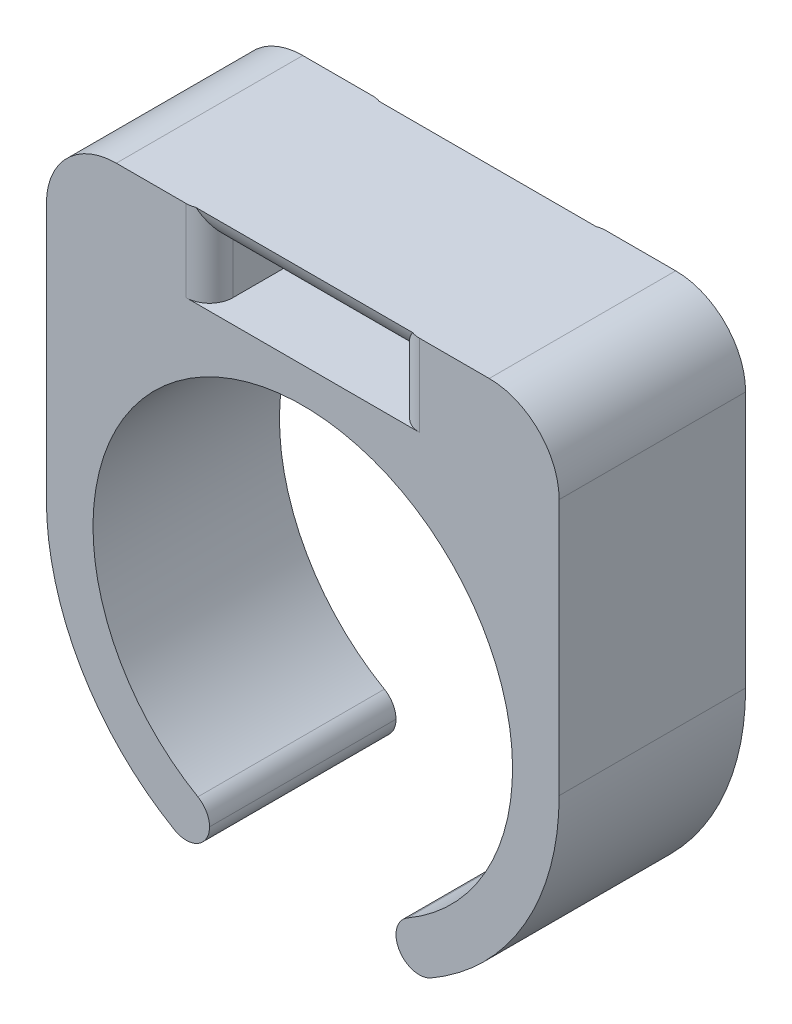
ISO-10303-21;
HEADER;
FILE_DESCRIPTION(('STEP AP214'),'2;1');
FILE_NAME('part.step','',(''),(''),'','','');
FILE_SCHEMA(('AUTOMOTIVE_DESIGN { 1 0 10303 214 1 1 1 1 }'));
ENDSEC;
DATA;
#1=APPLICATION_CONTEXT('core data for automotive mechanical design processes');
#2=APPLICATION_PROTOCOL_DEFINITION('international standard','automotive_design',2000,#1);
#3=PRODUCT_CONTEXT('',#1,'mechanical');
#4=PRODUCT('Part','Part','',(#3));
#5=PRODUCT_RELATED_PRODUCT_CATEGORY('part','',(#4));
#6=PRODUCT_DEFINITION_FORMATION('','',#4);
#7=PRODUCT_DEFINITION_CONTEXT('part definition',#1,'design');
#8=PRODUCT_DEFINITION('design','',#6,#7);
#9=PRODUCT_DEFINITION_SHAPE('','',#8);
#10=(LENGTH_UNIT() NAMED_UNIT(*) SI_UNIT(.MILLI.,.METRE.));
#11=(NAMED_UNIT(*) PLANE_ANGLE_UNIT() SI_UNIT($,.RADIAN.));
#12=(NAMED_UNIT(*) SI_UNIT($,.STERADIAN.) SOLID_ANGLE_UNIT());
#13=UNCERTAINTY_MEASURE_WITH_UNIT(LENGTH_MEASURE(1.E-05),#10,'distance_accuracy_value','');
#14=(GEOMETRIC_REPRESENTATION_CONTEXT(3) GLOBAL_UNCERTAINTY_ASSIGNED_CONTEXT((#13)) GLOBAL_UNIT_ASSIGNED_CONTEXT((#10,
#11,#12)) REPRESENTATION_CONTEXT('',''));
#15=CARTESIAN_POINT('',(0.,0.,0.));
#16=DIRECTION('',(0.,0.,1.));
#17=DIRECTION('',(1.,0.,0.));
#18=AXIS2_PLACEMENT_3D('',#15,#16,#17);
#19=CARTESIAN_POINT('',(0.,0.,8.));
#20=DIRECTION('',(0.,0.,-1.));
#21=DIRECTION('',(-1.,0.,0.));
#22=AXIS2_PLACEMENT_3D('',#19,#20,#21);
#23=CYLINDRICAL_SURFACE('',#22,11.);
#24=CARTESIAN_POINT('',(0.,0.,0.));
#25=DIRECTION('',(0.,0.,1.));
#26=DIRECTION('',(1.,0.,0.));
#27=AXIS2_PLACEMENT_3D('',#24,#25,#26);
#28=CIRCLE('',#27,11.);
#29=CARTESIAN_POINT('',(-11.,0.,0.));
#30=VERTEX_POINT('',#29);
#31=CARTESIAN_POINT('',(-5.5,-9.52627944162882,0.));
#32=VERTEX_POINT('',#31);
#33=EDGE_CURVE('E205',#30,#32,#28,.T.);
#34=ORIENTED_EDGE('',*,*,#33,.T.);
#35=DIRECTION('',(0.,0.,-1.));
#36=VECTOR('',#35,1.);
#37=CARTESIAN_POINT('',(-5.5,-9.52627944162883,8.));
#38=LINE('',#37,#36);
#39=CARTESIAN_POINT('',(-5.5,-9.52627944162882,8.));
#40=VERTEX_POINT('',#39);
#41=EDGE_CURVE('E290',#32,#40,#38,.F.);
#42=ORIENTED_EDGE('',*,*,#41,.T.);
#43=CARTESIAN_POINT('',(0.,0.,8.));
#44=DIRECTION('',(0.,0.,1.));
#45=DIRECTION('',(1.,0.,0.));
#46=AXIS2_PLACEMENT_3D('',#43,#44,#45);
#47=CIRCLE('',#46,11.);
#48=CARTESIAN_POINT('',(-11.,0.,8.));
#49=VERTEX_POINT('',#48);
#50=EDGE_CURVE('E246',#49,#40,#47,.T.);
#51=ORIENTED_EDGE('',*,*,#50,.F.);
#52=DIRECTION('',(0.,0.,1.));
#53=VECTOR('',#52,1.);
#54=CARTESIAN_POINT('',(-11.,0.,0.));
#55=LINE('',#54,#53);
#56=EDGE_CURVE('E218',#30,#49,#55,.T.);
#57=ORIENTED_EDGE('',*,*,#56,.F.);
#58=EDGE_LOOP('',(#34,#42,#51,#57));
#59=FACE_BOUND('',#58,.T.);
#60=ADVANCED_FACE('F33',(#59),#23,.T.);
#61=CARTESIAN_POINT('',(5.5,-9.52627944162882,8.));
#62=VERTEX_POINT('',#61);
#63=CARTESIAN_POINT('',(11.,0.,8.));
#64=VERTEX_POINT('',#63);
#65=EDGE_CURVE('E249',#62,#64,#47,.T.);
#66=ORIENTED_EDGE('',*,*,#65,.F.);
#67=DIRECTION('',(0.,0.,-1.));
#68=VECTOR('',#67,1.);
#69=CARTESIAN_POINT('',(5.5,-9.52627944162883,8.));
#70=LINE('',#69,#68);
#71=CARTESIAN_POINT('',(5.5,-9.52627944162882,0.));
#72=VERTEX_POINT('',#71);
#73=EDGE_CURVE('E202',#62,#72,#70,.T.);
#74=ORIENTED_EDGE('',*,*,#73,.T.);
#75=CARTESIAN_POINT('',(11.,0.,0.));
#76=VERTEX_POINT('',#75);
#77=EDGE_CURVE('E196',#72,#76,#28,.T.);
#78=ORIENTED_EDGE('',*,*,#77,.T.);
#79=DIRECTION('',(0.,0.,1.));
#80=VECTOR('',#79,1.);
#81=CARTESIAN_POINT('',(11.,0.,0.));
#82=LINE('',#81,#80);
#83=EDGE_CURVE('E200',#76,#64,#82,.T.);
#84=ORIENTED_EDGE('',*,*,#83,.T.);
#85=EDGE_LOOP('',(#66,#74,#78,#84));
#86=FACE_BOUND('',#85,.T.);
#87=ADVANCED_FACE('F199',(#86),#23,.T.);
#88=CARTESIAN_POINT('',(0.,0.,8.));
#89=DIRECTION('',(0.,0.,1.));
#90=DIRECTION('',(1.,0.,0.));
#91=AXIS2_PLACEMENT_3D('',#88,#89,#90);
#92=PLANE('',#91);
#93=DIRECTION('',(1.,0.,0.));
#94=VECTOR('',#93,1.);
#95=CARTESIAN_POINT('',(-11.,14.,8.));
#96=LINE('',#95,#94);
#97=CARTESIAN_POINT('',(5.,14.,8.));
#98=VERTEX_POINT('',#97);
#99=CARTESIAN_POINT('',(8.,14.,8.));
#100=VERTEX_POINT('',#99);
#101=EDGE_CURVE('E235',#98,#100,#96,.T.);
#102=ORIENTED_EDGE('',*,*,#101,.F.);
#103=DIRECTION('',(0.,1.,0.));
#104=VECTOR('',#103,1.);
#105=CARTESIAN_POINT('',(5.,10.5,8.));
#106=LINE('',#105,#104);
#107=CARTESIAN_POINT('',(5.,10.5,8.));
#108=VERTEX_POINT('',#107);
#109=EDGE_CURVE('E347',#98,#108,#106,.F.);
#110=ORIENTED_EDGE('',*,*,#109,.T.);
#111=DIRECTION('',(1.,0.,0.));
#112=VECTOR('',#111,1.);
#113=CARTESIAN_POINT('',(-4.,10.5,8.));
#114=LINE('',#113,#112);
#115=CARTESIAN_POINT('',(-5.,10.5,8.));
#116=VERTEX_POINT('',#115);
#117=EDGE_CURVE('E53',#116,#108,#114,.T.);
#118=ORIENTED_EDGE('',*,*,#117,.F.);
#119=DIRECTION('',(0.,-1.,0.));
#120=VECTOR('',#119,1.);
#121=CARTESIAN_POINT('',(-5.,14.,8.));
#122=LINE('',#121,#120);
#123=CARTESIAN_POINT('',(-5.,14.,8.));
#124=VERTEX_POINT('',#123);
#125=EDGE_CURVE('E345',#116,#124,#122,.F.);
#126=ORIENTED_EDGE('',*,*,#125,.T.);
#127=CARTESIAN_POINT('',(-8.,14.,8.));
#128=VERTEX_POINT('',#127);
#129=EDGE_CURVE('E237',#128,#124,#96,.T.);
#130=ORIENTED_EDGE('',*,*,#129,.F.);
#131=CARTESIAN_POINT('',(-8.,11.,8.));
#132=DIRECTION('',(0.,0.,1.));
#133=DIRECTION('',(1.,0.,0.));
#134=AXIS2_PLACEMENT_3D('',#131,#132,#133);
#135=CIRCLE('',#134,3.);
#136=CARTESIAN_POINT('',(-11.,11.,8.));
#137=VERTEX_POINT('',#136);
#138=EDGE_CURVE('E253',#128,#137,#135,.T.);
#139=ORIENTED_EDGE('',*,*,#138,.T.);
#140=DIRECTION('',(0.,1.,0.));
#141=VECTOR('',#140,1.);
#142=CARTESIAN_POINT('',(-11.,0.,8.));
#143=LINE('',#142,#141);
#144=EDGE_CURVE('E232',#49,#137,#143,.T.);
#145=ORIENTED_EDGE('',*,*,#144,.F.);
#146=ORIENTED_EDGE('',*,*,#50,.T.);
#147=CARTESIAN_POINT('',(-5.,-8.66025403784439,8.));
#148=DIRECTION('',(0.,0.,1.));
#149=DIRECTION('',(1.,0.,0.));
#150=AXIS2_PLACEMENT_3D('',#147,#148,#149);
#151=CIRCLE('',#150,1.);
#152=CARTESIAN_POINT('',(-4.,-8.66025403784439,8.));
#153=VERTEX_POINT('',#152);
#154=EDGE_CURVE('E280',#40,#153,#151,.T.);
#155=ORIENTED_EDGE('',*,*,#154,.T.);
#156=CARTESIAN_POINT('',(-5.,-8.66025403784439,8.));
#157=DIRECTION('',(0.,0.,1.));
#158=DIRECTION('',(1.,0.,0.));
#159=AXIS2_PLACEMENT_3D('',#156,#157,#158);
#160=CIRCLE('',#159,1.);
#161=CARTESIAN_POINT('',(-4.5,-7.79422863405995,8.));
#162=VERTEX_POINT('',#161);
#163=EDGE_CURVE('E278',#153,#162,#160,.T.);
#164=ORIENTED_EDGE('',*,*,#163,.T.);
#165=CARTESIAN_POINT('',(0.,0.,8.));
#166=DIRECTION('',(0.,0.,1.));
#167=DIRECTION('',(1.,0.,0.));
#168=AXIS2_PLACEMENT_3D('',#165,#166,#167);
#169=CIRCLE('',#168,9.);
#170=CARTESIAN_POINT('',(4.5,-7.79422863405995,8.));
#171=VERTEX_POINT('',#170);
#172=EDGE_CURVE('E206',#171,#162,#169,.T.);
#173=ORIENTED_EDGE('',*,*,#172,.F.);
#174=CARTESIAN_POINT('',(5.,-8.66025403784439,8.));
#175=DIRECTION('',(0.,0.,1.));
#176=DIRECTION('',(1.,0.,0.));
#177=AXIS2_PLACEMENT_3D('',#174,#175,#176);
#178=CIRCLE('',#177,1.);
#179=CARTESIAN_POINT('',(4.,-8.66025403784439,8.));
#180=VERTEX_POINT('',#179);
#181=EDGE_CURVE('E282',#171,#180,#178,.T.);
#182=ORIENTED_EDGE('',*,*,#181,.T.);
#183=CARTESIAN_POINT('',(5.,-8.66025403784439,8.));
#184=DIRECTION('',(0.,0.,1.));
#185=DIRECTION('',(1.,0.,0.));
#186=AXIS2_PLACEMENT_3D('',#183,#184,#185);
#187=CIRCLE('',#186,1.);
#188=EDGE_CURVE('E284',#180,#62,#187,.T.);
#189=ORIENTED_EDGE('',*,*,#188,.T.);
#190=ORIENTED_EDGE('',*,*,#65,.T.);
#191=DIRECTION('',(0.,1.,0.));
#192=VECTOR('',#191,1.);
#193=CARTESIAN_POINT('',(11.,0.,8.));
#194=LINE('',#193,#192);
#195=CARTESIAN_POINT('',(11.,11.,8.));
#196=VERTEX_POINT('',#195);
#197=EDGE_CURVE('E216',#64,#196,#194,.T.);
#198=ORIENTED_EDGE('',*,*,#197,.T.);
#199=CARTESIAN_POINT('',(8.,11.,8.));
#200=DIRECTION('',(0.,0.,1.));
#201=DIRECTION('',(1.,0.,0.));
#202=AXIS2_PLACEMENT_3D('',#199,#200,#201);
#203=CIRCLE('',#202,3.);
#204=EDGE_CURVE('E255',#196,#100,#203,.T.);
#205=ORIENTED_EDGE('',*,*,#204,.T.);
#206=EDGE_LOOP('',(#102,#110,#118,#126,#130,#139,#145,#146,#155,#164,#173,#182,#189,#190,#198,#205));
#207=FACE_BOUND('',#206,.T.);
#208=ADVANCED_FACE('F409',(#207),#92,.T.);
#209=CARTESIAN_POINT('',(0.,0.,0.));
#210=DIRECTION('',(0.,0.,1.));
#211=DIRECTION('',(1.,0.,0.));
#212=AXIS2_PLACEMENT_3D('',#209,#210,#211);
#213=PLANE('',#212);
#214=DIRECTION('',(1.,0.,0.));
#215=VECTOR('',#214,1.);
#216=CARTESIAN_POINT('',(-11.,14.,0.));
#217=LINE('',#216,#215);
#218=CARTESIAN_POINT('',(-8.,14.,0.));
#219=VERTEX_POINT('',#218);
#220=CARTESIAN_POINT('',(-5.,14.,0.));
#221=VERTEX_POINT('',#220);
#222=EDGE_CURVE('E224',#219,#221,#217,.T.);
#223=ORIENTED_EDGE('',*,*,#222,.T.);
#224=DIRECTION('',(0.,-1.,0.));
#225=VECTOR('',#224,1.);
#226=CARTESIAN_POINT('',(-5.,0.,0.));
#227=LINE('',#226,#225);
#228=CARTESIAN_POINT('',(-5.,10.5,0.));
#229=VERTEX_POINT('',#228);
#230=EDGE_CURVE('E322',#221,#229,#227,.T.);
#231=ORIENTED_EDGE('',*,*,#230,.T.);
#232=DIRECTION('',(1.,0.,0.));
#233=VECTOR('',#232,1.);
#234=CARTESIAN_POINT('',(-4.,10.5,0.));
#235=LINE('',#234,#233);
#236=CARTESIAN_POINT('',(5.,10.5,0.));
#237=VERTEX_POINT('',#236);
#238=EDGE_CURVE('E453',#229,#237,#235,.T.);
#239=ORIENTED_EDGE('',*,*,#238,.T.);
#240=DIRECTION('',(0.,1.,0.));
#241=VECTOR('',#240,1.);
#242=CARTESIAN_POINT('',(5.,0.,0.));
#243=LINE('',#242,#241);
#244=CARTESIAN_POINT('',(5.,14.,0.));
#245=VERTEX_POINT('',#244);
#246=EDGE_CURVE('E319',#237,#245,#243,.T.);
#247=ORIENTED_EDGE('',*,*,#246,.T.);
#248=CARTESIAN_POINT('',(8.,14.,0.));
#249=VERTEX_POINT('',#248);
#250=EDGE_CURVE('E228',#245,#249,#217,.T.);
#251=ORIENTED_EDGE('',*,*,#250,.T.);
#252=CARTESIAN_POINT('',(8.,11.,0.));
#253=DIRECTION('',(0.,0.,1.));
#254=DIRECTION('',(1.,0.,0.));
#255=AXIS2_PLACEMENT_3D('',#252,#253,#254);
#256=CIRCLE('',#255,3.);
#257=CARTESIAN_POINT('',(11.,11.,0.));
#258=VERTEX_POINT('',#257);
#259=EDGE_CURVE('E223',#249,#258,#256,.F.);
#260=ORIENTED_EDGE('',*,*,#259,.T.);
#261=DIRECTION('',(0.,1.,0.));
#262=VECTOR('',#261,1.);
#263=CARTESIAN_POINT('',(11.,0.,0.));
#264=LINE('',#263,#262);
#265=EDGE_CURVE('E213',#76,#258,#264,.T.);
#266=ORIENTED_EDGE('',*,*,#265,.F.);
#267=ORIENTED_EDGE('',*,*,#77,.F.);
#268=CARTESIAN_POINT('',(5.,-8.66025403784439,0.));
#269=DIRECTION('',(0.,0.,1.));
#270=DIRECTION('',(1.,0.,0.));
#271=AXIS2_PLACEMENT_3D('',#268,#269,#270);
#272=CIRCLE('',#271,1.);
#273=CARTESIAN_POINT('',(4.,-8.66025403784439,0.));
#274=VERTEX_POINT('',#273);
#275=EDGE_CURVE('E276',#72,#274,#272,.F.);
#276=ORIENTED_EDGE('',*,*,#275,.T.);
#277=CARTESIAN_POINT('',(5.,-8.66025403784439,0.));
#278=DIRECTION('',(0.,0.,1.));
#279=DIRECTION('',(1.,0.,0.));
#280=AXIS2_PLACEMENT_3D('',#277,#278,#279);
#281=CIRCLE('',#280,1.);
#282=CARTESIAN_POINT('',(4.5,-7.79422863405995,0.));
#283=VERTEX_POINT('',#282);
#284=EDGE_CURVE('E274',#274,#283,#281,.F.);
#285=ORIENTED_EDGE('',*,*,#284,.T.);
#286=CARTESIAN_POINT('',(0.,0.,0.));
#287=DIRECTION('',(0.,0.,1.));
#288=DIRECTION('',(1.,0.,0.));
#289=AXIS2_PLACEMENT_3D('',#286,#287,#288);
#290=CIRCLE('',#289,9.);
#291=CARTESIAN_POINT('',(-4.5,-7.79422863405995,0.));
#292=VERTEX_POINT('',#291);
#293=EDGE_CURVE('E217',#283,#292,#290,.T.);
#294=ORIENTED_EDGE('',*,*,#293,.T.);
#295=CARTESIAN_POINT('',(-5.,-8.66025403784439,0.));
#296=DIRECTION('',(0.,0.,1.));
#297=DIRECTION('',(1.,0.,0.));
#298=AXIS2_PLACEMENT_3D('',#295,#296,#297);
#299=CIRCLE('',#298,1.);
#300=CARTESIAN_POINT('',(-4.,-8.66025403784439,0.));
#301=VERTEX_POINT('',#300);
#302=EDGE_CURVE('E270',#292,#301,#299,.F.);
#303=ORIENTED_EDGE('',*,*,#302,.T.);
#304=CARTESIAN_POINT('',(-5.,-8.66025403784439,0.));
#305=DIRECTION('',(0.,0.,1.));
#306=DIRECTION('',(1.,0.,0.));
#307=AXIS2_PLACEMENT_3D('',#304,#305,#306);
#308=CIRCLE('',#307,1.);
#309=EDGE_CURVE('E272',#301,#32,#308,.F.);
#310=ORIENTED_EDGE('',*,*,#309,.T.);
#311=ORIENTED_EDGE('',*,*,#33,.F.);
#312=DIRECTION('',(0.,1.,0.));
#313=VECTOR('',#312,1.);
#314=CARTESIAN_POINT('',(-11.,0.,0.));
#315=LINE('',#314,#313);
#316=CARTESIAN_POINT('',(-11.,11.,0.));
#317=VERTEX_POINT('',#316);
#318=EDGE_CURVE('E240',#30,#317,#315,.T.);
#319=ORIENTED_EDGE('',*,*,#318,.T.);
#320=CARTESIAN_POINT('',(-8.,11.,0.));
#321=DIRECTION('',(0.,0.,1.));
#322=DIRECTION('',(1.,0.,0.));
#323=AXIS2_PLACEMENT_3D('',#320,#321,#322);
#324=CIRCLE('',#323,3.);
#325=EDGE_CURVE('E264',#317,#219,#324,.F.);
#326=ORIENTED_EDGE('',*,*,#325,.T.);
#327=EDGE_LOOP('',(#223,#231,#239,#247,#251,#260,#266,#267,#276,#285,#294,#303,#310,#311,#319,#326));
#328=FACE_BOUND('',#327,.T.);
#329=ADVANCED_FACE('F221',(#328),#213,.F.);
#330=CARTESIAN_POINT('',(0.,0.,8.));
#331=DIRECTION('',(0.,0.,-1.));
#332=DIRECTION('',(-1.,0.,0.));
#333=AXIS2_PLACEMENT_3D('',#330,#331,#332);
#334=CYLINDRICAL_SURFACE('',#333,9.);
#335=ORIENTED_EDGE('',*,*,#293,.F.);
#336=DIRECTION('',(0.,0.,-1.));
#337=VECTOR('',#336,1.);
#338=CARTESIAN_POINT('',(4.5,-7.79422863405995,8.));
#339=LINE('',#338,#337);
#340=EDGE_CURVE('E288',#283,#171,#339,.F.);
#341=ORIENTED_EDGE('',*,*,#340,.T.);
#342=ORIENTED_EDGE('',*,*,#172,.T.);
#343=DIRECTION('',(0.,0.,-1.));
#344=VECTOR('',#343,1.);
#345=CARTESIAN_POINT('',(-4.5,-7.79422863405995,8.));
#346=LINE('',#345,#344);
#347=EDGE_CURVE('E286',#162,#292,#346,.T.);
#348=ORIENTED_EDGE('',*,*,#347,.T.);
#349=EDGE_LOOP('',(#335,#341,#342,#348));
#350=FACE_BOUND('',#349,.T.);
#351=ADVANCED_FACE('F482',(#350),#334,.F.);
#352=CARTESIAN_POINT('',(-11.,0.,0.));
#353=DIRECTION('',(1.,0.,0.));
#354=DIRECTION('',(0.,1.,0.));
#355=AXIS2_PLACEMENT_3D('',#352,#353,#354);
#356=PLANE('',#355);
#357=ORIENTED_EDGE('',*,*,#144,.T.);
#358=DIRECTION('',(0.,0.,1.));
#359=VECTOR('',#358,1.);
#360=CARTESIAN_POINT('',(-11.,11.,0.));
#361=LINE('',#360,#359);
#362=EDGE_CURVE('E267',#137,#317,#361,.F.);
#363=ORIENTED_EDGE('',*,*,#362,.T.);
#364=ORIENTED_EDGE('',*,*,#318,.F.);
#365=ORIENTED_EDGE('',*,*,#56,.T.);
#366=EDGE_LOOP('',(#357,#363,#364,#365));
#367=FACE_BOUND('',#366,.T.);
#368=ADVANCED_FACE('F445',(#367),#356,.F.);
#369=CARTESIAN_POINT('',(-11.,14.,0.));
#370=DIRECTION('',(0.,-1.,0.));
#371=DIRECTION('',(0.,0.,-1.));
#372=AXIS2_PLACEMENT_3D('',#369,#370,#371);
#373=PLANE('',#372);
#374=DIRECTION('',(-1.,0.,0.));
#375=VECTOR('',#374,1.);
#376=CARTESIAN_POINT('',(0.,14.,0.0635083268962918));
#377=LINE('',#376,#375);
#378=CARTESIAN_POINT('',(4.64931018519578,14.,0.0635083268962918));
#379=VERTEX_POINT('',#378);
#380=CARTESIAN_POINT('',(-4.64931018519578,14.,0.0635083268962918));
#381=VERTEX_POINT('',#380);
#382=EDGE_CURVE('E301',#379,#381,#377,.T.);
#383=ORIENTED_EDGE('',*,*,#382,.T.);
#384=CARTESIAN_POINT('',(-5.,14.,1.));
#385=DIRECTION('',(0.,-1.,0.));
#386=DIRECTION('',(0.,0.,-1.));
#387=AXIS2_PLACEMENT_3D('',#384,#385,#386);
#388=CIRCLE('',#387,1.);
#389=EDGE_CURVE('E338',#381,#221,#388,.F.);
#390=ORIENTED_EDGE('',*,*,#389,.T.);
#391=ORIENTED_EDGE('',*,*,#222,.F.);
#392=DIRECTION('',(0.,0.,1.));
#393=VECTOR('',#392,1.);
#394=CARTESIAN_POINT('',(-8.,14.,0.));
#395=LINE('',#394,#393);
#396=EDGE_CURVE('E258',#219,#128,#395,.T.);
#397=ORIENTED_EDGE('',*,*,#396,.T.);
#398=ORIENTED_EDGE('',*,*,#129,.T.);
#399=CARTESIAN_POINT('',(-5.,14.,7.));
#400=DIRECTION('',(0.,-1.,0.));
#401=DIRECTION('',(0.,0.,-1.));
#402=AXIS2_PLACEMENT_3D('',#399,#400,#401);
#403=CIRCLE('',#402,1.);
#404=CARTESIAN_POINT('',(-4.64931018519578,14.,7.93649167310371));
#405=VERTEX_POINT('',#404);
#406=EDGE_CURVE('E330',#124,#405,#403,.F.);
#407=ORIENTED_EDGE('',*,*,#406,.T.);
#408=DIRECTION('',(1.,0.,0.));
#409=VECTOR('',#408,1.);
#410=CARTESIAN_POINT('',(0.,14.,7.93649167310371));
#411=LINE('',#410,#409);
#412=CARTESIAN_POINT('',(4.64931018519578,14.,7.93649167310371));
#413=VERTEX_POINT('',#412);
#414=EDGE_CURVE('E293',#405,#413,#411,.T.);
#415=ORIENTED_EDGE('',*,*,#414,.T.);
#416=CARTESIAN_POINT('',(5.,14.,7.));
#417=DIRECTION('',(0.,-1.,0.));
#418=DIRECTION('',(0.,0.,-1.));
#419=AXIS2_PLACEMENT_3D('',#416,#417,#418);
#420=CIRCLE('',#419,1.);
#421=EDGE_CURVE('E333',#413,#98,#420,.F.);
#422=ORIENTED_EDGE('',*,*,#421,.T.);
#423=ORIENTED_EDGE('',*,*,#101,.T.);
#424=DIRECTION('',(0.,0.,1.));
#425=VECTOR('',#424,1.);
#426=CARTESIAN_POINT('',(8.,14.,0.));
#427=LINE('',#426,#425);
#428=EDGE_CURVE('E261',#100,#249,#427,.F.);
#429=ORIENTED_EDGE('',*,*,#428,.T.);
#430=ORIENTED_EDGE('',*,*,#250,.F.);
#431=CARTESIAN_POINT('',(5.,14.,1.));
#432=DIRECTION('',(0.,-1.,0.));
#433=DIRECTION('',(0.,0.,-1.));
#434=AXIS2_PLACEMENT_3D('',#431,#432,#433);
#435=CIRCLE('',#434,1.);
#436=EDGE_CURVE('E335',#245,#379,#435,.F.);
#437=ORIENTED_EDGE('',*,*,#436,.T.);
#438=EDGE_LOOP('',(#383,#390,#391,#397,#398,#407,#415,#422,#423,#429,#430,#437));
#439=FACE_BOUND('',#438,.T.);
#440=ADVANCED_FACE('F471',(#439),#373,.F.);
#441=CARTESIAN_POINT('',(11.,0.,0.));
#442=DIRECTION('',(1.,0.,0.));
#443=DIRECTION('',(0.,1.,0.));
#444=AXIS2_PLACEMENT_3D('',#441,#442,#443);
#445=PLANE('',#444);
#446=ORIENTED_EDGE('',*,*,#265,.T.);
#447=DIRECTION('',(0.,0.,1.));
#448=VECTOR('',#447,1.);
#449=CARTESIAN_POINT('',(11.,11.,8.));
#450=LINE('',#449,#448);
#451=EDGE_CURVE('E248',#258,#196,#450,.T.);
#452=ORIENTED_EDGE('',*,*,#451,.T.);
#453=ORIENTED_EDGE('',*,*,#197,.F.);
#454=ORIENTED_EDGE('',*,*,#83,.F.);
#455=EDGE_LOOP('',(#446,#452,#453,#454));
#456=FACE_BOUND('',#455,.T.);
#457=ADVANCED_FACE('F211',(#456),#445,.T.);
#458=CARTESIAN_POINT('',(8.,11.,0.));
#459=DIRECTION('',(0.,0.,-1.));
#460=DIRECTION('',(-1.,0.,0.));
#461=AXIS2_PLACEMENT_3D('',#458,#459,#460);
#462=CYLINDRICAL_SURFACE('',#461,3.);
#463=ORIENTED_EDGE('',*,*,#259,.F.);
#464=ORIENTED_EDGE('',*,*,#428,.F.);
#465=ORIENTED_EDGE('',*,*,#204,.F.);
#466=ORIENTED_EDGE('',*,*,#451,.F.);
#467=EDGE_LOOP('',(#463,#464,#465,#466));
#468=FACE_BOUND('',#467,.T.);
#469=ADVANCED_FACE('F413',(#468),#462,.T.);
#470=CARTESIAN_POINT('',(-8.,11.,0.));
#471=DIRECTION('',(0.,0.,1.));
#472=DIRECTION('',(1.,0.,0.));
#473=AXIS2_PLACEMENT_3D('',#470,#471,#472);
#474=CYLINDRICAL_SURFACE('',#473,3.);
#475=ORIENTED_EDGE('',*,*,#325,.F.);
#476=ORIENTED_EDGE('',*,*,#362,.F.);
#477=ORIENTED_EDGE('',*,*,#138,.F.);
#478=ORIENTED_EDGE('',*,*,#396,.F.);
#479=EDGE_LOOP('',(#475,#476,#477,#478));
#480=FACE_BOUND('',#479,.T.);
#481=ADVANCED_FACE('F416',(#480),#474,.T.);
#482=CARTESIAN_POINT('',(-4.,12.5,0.));
#483=DIRECTION('',(-1.,0.,0.));
#484=DIRECTION('',(0.,0.,1.));
#485=AXIS2_PLACEMENT_3D('',#482,#483,#484);
#486=PLANE('',#485);
#487=DIRECTION('',(0.,0.,1.));
#488=VECTOR('',#487,1.);
#489=CARTESIAN_POINT('',(-4.,10.5,0.));
#490=LINE('',#489,#488);
#491=CARTESIAN_POINT('',(-4.,10.5,1.));
#492=VERTEX_POINT('',#491);
#493=CARTESIAN_POINT('',(-4.,10.5,7.));
#494=VERTEX_POINT('',#493);
#495=EDGE_CURVE('E449',#492,#494,#490,.T.);
#496=ORIENTED_EDGE('',*,*,#495,.F.);
#497=DIRECTION('',(0.,-1.,0.));
#498=VECTOR('',#497,1.);
#499=CARTESIAN_POINT('',(-4.,12.5,1.));
#500=LINE('',#499,#498);
#501=CARTESIAN_POINT('',(-4.,12.7679491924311,1.));
#502=VERTEX_POINT('',#501);
#503=EDGE_CURVE('E328',#492,#502,#500,.F.);
#504=ORIENTED_EDGE('',*,*,#503,.T.);
#505=CARTESIAN_POINT('',(-4.,14.5,2.));
#506=DIRECTION('',(-1.,0.,0.));
#507=DIRECTION('',(0.,0.,1.));
#508=AXIS2_PLACEMENT_3D('',#505,#506,#507);
#509=CIRCLE('',#508,2.);
#510=CARTESIAN_POINT('',(-4.,12.5,2.));
#511=VERTEX_POINT('',#510);
#512=EDGE_CURVE('E309',#502,#511,#509,.T.);
#513=ORIENTED_EDGE('',*,*,#512,.T.);
#514=DIRECTION('',(0.,0.,1.));
#515=VECTOR('',#514,1.);
#516=CARTESIAN_POINT('',(-4.,12.5,0.));
#517=LINE('',#516,#515);
#518=CARTESIAN_POINT('',(-4.,12.5,6.));
#519=VERTEX_POINT('',#518);
#520=EDGE_CURVE('E236',#511,#519,#517,.T.);
#521=ORIENTED_EDGE('',*,*,#520,.T.);
#522=CARTESIAN_POINT('',(-4.,14.5,6.));
#523=DIRECTION('',(-1.,0.,0.));
#524=DIRECTION('',(0.,0.,1.));
#525=AXIS2_PLACEMENT_3D('',#522,#523,#524);
#526=CIRCLE('',#525,2.);
#527=CARTESIAN_POINT('',(-4.,12.7679491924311,7.));
#528=VERTEX_POINT('',#527);
#529=EDGE_CURVE('E314',#519,#528,#526,.T.);
#530=ORIENTED_EDGE('',*,*,#529,.T.);
#531=DIRECTION('',(0.,-1.,0.));
#532=VECTOR('',#531,1.);
#533=CARTESIAN_POINT('',(-4.,10.5,7.));
#534=LINE('',#533,#532);
#535=EDGE_CURVE('E325',#528,#494,#534,.T.);
#536=ORIENTED_EDGE('',*,*,#535,.T.);
#537=EDGE_LOOP('',(#496,#504,#513,#521,#530,#536));
#538=FACE_BOUND('',#537,.T.);
#539=ADVANCED_FACE('F420',(#538),#486,.F.);
#540=CARTESIAN_POINT('',(-4.,12.5,0.));
#541=DIRECTION('',(0.,1.,0.));
#542=DIRECTION('',(0.,0.,1.));
#543=AXIS2_PLACEMENT_3D('',#540,#541,#542);
#544=PLANE('',#543);
#545=ORIENTED_EDGE('',*,*,#520,.F.);
#546=DIRECTION('',(-1.,0.,0.));
#547=VECTOR('',#546,1.);
#548=CARTESIAN_POINT('',(-4.,12.5,2.));
#549=LINE('',#548,#547);
#550=CARTESIAN_POINT('',(4.,12.5,2.));
#551=VERTEX_POINT('',#550);
#552=EDGE_CURVE('E306',#511,#551,#549,.F.);
#553=ORIENTED_EDGE('',*,*,#552,.T.);
#554=DIRECTION('',(0.,0.,1.));
#555=VECTOR('',#554,1.);
#556=CARTESIAN_POINT('',(4.,12.5,0.));
#557=LINE('',#556,#555);
#558=CARTESIAN_POINT('',(4.,12.5,6.));
#559=VERTEX_POINT('',#558);
#560=EDGE_CURVE('E456',#551,#559,#557,.T.);
#561=ORIENTED_EDGE('',*,*,#560,.T.);
#562=DIRECTION('',(-1.,0.,0.));
#563=VECTOR('',#562,1.);
#564=CARTESIAN_POINT('',(-4.,12.5,6.));
#565=LINE('',#564,#563);
#566=EDGE_CURVE('E303',#559,#519,#565,.T.);
#567=ORIENTED_EDGE('',*,*,#566,.T.);
#568=EDGE_LOOP('',(#545,#553,#561,#567));
#569=FACE_BOUND('',#568,.T.);
#570=ADVANCED_FACE('F510',(#569),#544,.F.);
#571=CARTESIAN_POINT('',(4.,12.5,0.));
#572=DIRECTION('',(1.,0.,0.));
#573=DIRECTION('',(0.,0.,-1.));
#574=AXIS2_PLACEMENT_3D('',#571,#572,#573);
#575=PLANE('',#574);
#576=CARTESIAN_POINT('',(4.,14.5,2.));
#577=DIRECTION('',(1.,0.,0.));
#578=DIRECTION('',(0.,0.,-1.));
#579=AXIS2_PLACEMENT_3D('',#576,#577,#578);
#580=CIRCLE('',#579,2.);
#581=CARTESIAN_POINT('',(4.,12.7679491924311,1.));
#582=VERTEX_POINT('',#581);
#583=EDGE_CURVE('E311',#551,#582,#580,.T.);
#584=ORIENTED_EDGE('',*,*,#583,.T.);
#585=DIRECTION('',(0.,1.,0.));
#586=VECTOR('',#585,1.);
#587=CARTESIAN_POINT('',(4.,12.5,1.));
#588=LINE('',#587,#586);
#589=CARTESIAN_POINT('',(4.,10.5,1.));
#590=VERTEX_POINT('',#589);
#591=EDGE_CURVE('E343',#582,#590,#588,.F.);
#592=ORIENTED_EDGE('',*,*,#591,.T.);
#593=DIRECTION('',(0.,0.,1.));
#594=VECTOR('',#593,1.);
#595=CARTESIAN_POINT('',(4.,10.5,0.));
#596=LINE('',#595,#594);
#597=CARTESIAN_POINT('',(4.,10.5,7.));
#598=VERTEX_POINT('',#597);
#599=EDGE_CURVE('E452',#590,#598,#596,.T.);
#600=ORIENTED_EDGE('',*,*,#599,.T.);
#601=DIRECTION('',(0.,1.,0.));
#602=VECTOR('',#601,1.);
#603=CARTESIAN_POINT('',(4.,14.,7.));
#604=LINE('',#603,#602);
#605=CARTESIAN_POINT('',(4.,12.7679491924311,7.));
#606=VERTEX_POINT('',#605);
#607=EDGE_CURVE('E340',#598,#606,#604,.T.);
#608=ORIENTED_EDGE('',*,*,#607,.T.);
#609=CARTESIAN_POINT('',(4.,14.5,6.));
#610=DIRECTION('',(1.,0.,0.));
#611=DIRECTION('',(0.,0.,-1.));
#612=AXIS2_PLACEMENT_3D('',#609,#610,#611);
#613=CIRCLE('',#612,2.);
#614=EDGE_CURVE('E317',#606,#559,#613,.T.);
#615=ORIENTED_EDGE('',*,*,#614,.T.);
#616=ORIENTED_EDGE('',*,*,#560,.F.);
#617=EDGE_LOOP('',(#584,#592,#600,#608,#615,#616));
#618=FACE_BOUND('',#617,.T.);
#619=ADVANCED_FACE('F503',(#618),#575,.F.);
#620=CARTESIAN_POINT('',(-4.,10.5,0.));
#621=DIRECTION('',(0.,-1.,0.));
#622=DIRECTION('',(0.,0.,-1.));
#623=AXIS2_PLACEMENT_3D('',#620,#621,#622);
#624=PLANE('',#623);
#625=ORIENTED_EDGE('',*,*,#117,.T.);
#626=CARTESIAN_POINT('',(5.,10.5,7.));
#627=DIRECTION('',(0.,-1.,0.));
#628=DIRECTION('',(0.,0.,-1.));
#629=AXIS2_PLACEMENT_3D('',#626,#627,#628);
#630=CIRCLE('',#629,1.);
#631=EDGE_CURVE('E388',#108,#598,#630,.T.);
#632=ORIENTED_EDGE('',*,*,#631,.T.);
#633=ORIENTED_EDGE('',*,*,#599,.F.);
#634=CARTESIAN_POINT('',(5.,10.5,1.));
#635=DIRECTION('',(0.,-1.,0.));
#636=DIRECTION('',(0.,0.,-1.));
#637=AXIS2_PLACEMENT_3D('',#634,#635,#636);
#638=CIRCLE('',#637,1.);
#639=EDGE_CURVE('E389',#590,#237,#638,.T.);
#640=ORIENTED_EDGE('',*,*,#639,.T.);
#641=ORIENTED_EDGE('',*,*,#238,.F.);
#642=CARTESIAN_POINT('',(-5.,10.5,1.));
#643=DIRECTION('',(0.,-1.,0.));
#644=DIRECTION('',(0.,0.,-1.));
#645=AXIS2_PLACEMENT_3D('',#642,#643,#644);
#646=CIRCLE('',#645,1.);
#647=EDGE_CURVE('E349',#229,#492,#646,.T.);
#648=ORIENTED_EDGE('',*,*,#647,.T.);
#649=ORIENTED_EDGE('',*,*,#495,.T.);
#650=CARTESIAN_POINT('',(-5.,10.5,7.));
#651=DIRECTION('',(0.,-1.,0.));
#652=DIRECTION('',(0.,0.,-1.));
#653=AXIS2_PLACEMENT_3D('',#650,#651,#652);
#654=CIRCLE('',#653,1.);
#655=EDGE_CURVE('E46',#494,#116,#654,.T.);
#656=ORIENTED_EDGE('',*,*,#655,.T.);
#657=EDGE_LOOP('',(#625,#632,#633,#640,#641,#648,#649,#656));
#658=FACE_BOUND('',#657,.T.);
#659=ADVANCED_FACE('F428',(#658),#624,.F.);
#660=CARTESIAN_POINT('',(5.,-8.66025403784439,8.));
#661=DIRECTION('',(0.,0.,-1.));
#662=DIRECTION('',(-1.,0.,0.));
#663=AXIS2_PLACEMENT_3D('',#660,#661,#662);
#664=CYLINDRICAL_SURFACE('',#663,1.);
#665=DIRECTION('',(0.,0.,1.));
#666=VECTOR('',#665,1.);
#667=CARTESIAN_POINT('',(4.,-8.66025403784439,0.));
#668=LINE('',#667,#666);
#669=EDGE_CURVE('E294',#180,#274,#668,.F.);
#670=ORIENTED_EDGE('',*,*,#669,.F.);
#671=ORIENTED_EDGE('',*,*,#181,.F.);
#672=ORIENTED_EDGE('',*,*,#340,.F.);
#673=ORIENTED_EDGE('',*,*,#284,.F.);
#674=EDGE_LOOP('',(#670,#671,#672,#673));
#675=FACE_BOUND('',#674,.T.);
#676=ADVANCED_FACE('F425',(#675),#664,.T.);
#677=CARTESIAN_POINT('',(5.,-8.66025403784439,8.));
#678=DIRECTION('',(0.,0.,-1.));
#679=DIRECTION('',(-1.,0.,0.));
#680=AXIS2_PLACEMENT_3D('',#677,#678,#679);
#681=CYLINDRICAL_SURFACE('',#680,1.);
#682=ORIENTED_EDGE('',*,*,#188,.F.);
#683=ORIENTED_EDGE('',*,*,#669,.T.);
#684=ORIENTED_EDGE('',*,*,#275,.F.);
#685=ORIENTED_EDGE('',*,*,#73,.F.);
#686=EDGE_LOOP('',(#682,#683,#684,#685));
#687=FACE_BOUND('',#686,.T.);
#688=ADVANCED_FACE('F422',(#687),#681,.T.);
#689=CARTESIAN_POINT('',(-5.,-8.66025403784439,8.));
#690=DIRECTION('',(0.,0.,-1.));
#691=DIRECTION('',(-1.,0.,0.));
#692=AXIS2_PLACEMENT_3D('',#689,#690,#691);
#693=CYLINDRICAL_SURFACE('',#692,1.);
#694=DIRECTION('',(0.,0.,1.));
#695=VECTOR('',#694,1.);
#696=CARTESIAN_POINT('',(-4.,-8.66025403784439,8.));
#697=LINE('',#696,#695);
#698=EDGE_CURVE('E297',#301,#153,#697,.T.);
#699=ORIENTED_EDGE('',*,*,#698,.F.);
#700=ORIENTED_EDGE('',*,*,#302,.F.);
#701=ORIENTED_EDGE('',*,*,#347,.F.);
#702=ORIENTED_EDGE('',*,*,#163,.F.);
#703=EDGE_LOOP('',(#699,#700,#701,#702));
#704=FACE_BOUND('',#703,.T.);
#705=ADVANCED_FACE('F374',(#704),#693,.T.);
#706=CARTESIAN_POINT('',(-5.,-8.66025403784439,8.));
#707=DIRECTION('',(0.,0.,-1.));
#708=DIRECTION('',(-1.,0.,0.));
#709=AXIS2_PLACEMENT_3D('',#706,#707,#708);
#710=CYLINDRICAL_SURFACE('',#709,1.);
#711=ORIENTED_EDGE('',*,*,#309,.F.);
#712=ORIENTED_EDGE('',*,*,#698,.T.);
#713=ORIENTED_EDGE('',*,*,#154,.F.);
#714=ORIENTED_EDGE('',*,*,#41,.F.);
#715=EDGE_LOOP('',(#711,#712,#713,#714));
#716=FACE_BOUND('',#715,.T.);
#717=ADVANCED_FACE('F372',(#716),#710,.T.);
#718=CARTESIAN_POINT('',(0.,14.5,2.));
#719=DIRECTION('',(-1.,0.,0.));
#720=DIRECTION('',(0.,0.,1.));
#721=AXIS2_PLACEMENT_3D('',#718,#719,#720);
#722=CYLINDRICAL_SURFACE('',#721,2.);
#723=ORIENTED_EDGE('',*,*,#583,.F.);
#724=ORIENTED_EDGE('',*,*,#552,.F.);
#725=ORIENTED_EDGE('',*,*,#512,.F.);
#726=CARTESIAN_POINT('',(-4.,12.7679491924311,1.));
#727=CARTESIAN_POINT('',(-3.99999980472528,12.7895804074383,0.962507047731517));
#728=CARTESIAN_POINT('',(-4.00210694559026,12.812425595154,0.925773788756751));
#729=CARTESIAN_POINT('',(-4.01003083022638,12.8601787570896,0.854217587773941));
#730=CARTESIAN_POINT('',(-4.01583819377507,12.8850813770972,0.81939005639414));
#731=CARTESIAN_POINT('',(-4.0305511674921,12.936309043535,0.752351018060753));
#732=CARTESIAN_POINT('',(-4.03940894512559,12.9626071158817,0.720108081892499));
#733=CARTESIAN_POINT('',(-4.05980631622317,13.0167052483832,0.657784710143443));
#734=CARTESIAN_POINT('',(-4.07134784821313,13.0445063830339,0.627705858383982));
#735=CARTESIAN_POINT('',(-4.11418807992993,13.140546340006,0.529904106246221));
#736=CARTESIAN_POINT('',(-4.15081273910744,13.2117670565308,0.467361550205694));
#737=CARTESIAN_POINT('',(-4.23305326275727,13.3594134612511,0.354457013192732));
#738=CARTESIAN_POINT('',(-4.27874729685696,13.4358803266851,0.304210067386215));
#739=CARTESIAN_POINT('',(-4.37679658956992,13.5931278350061,0.215101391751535));
#740=CARTESIAN_POINT('',(-4.42924384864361,13.673956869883,0.176427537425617));
#741=CARTESIAN_POINT('',(-4.51042854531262,13.7960544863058,0.127475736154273));
#742=CARTESIAN_POINT('',(-4.53769745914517,13.8365918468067,0.112745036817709));
#743=CARTESIAN_POINT('',(-4.59298351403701,13.9180340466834,0.0860652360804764));
#744=CARTESIAN_POINT('',(-4.62100020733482,13.95893865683,0.0741145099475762));
#745=CARTESIAN_POINT('',(-4.64931018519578,14.,0.063508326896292));
#746=B_SPLINE_CURVE_WITH_KNOTS('',3,(#726,#727,#728,#729,#730,#731,#732,#733,#734,#735,#736,
#737,#738,#739,#740,#741,#742,#743,#744,#745),.UNSPECIFIED.,.F.,.F.,(4,2,2,2,2,2,2,2,2,4),(0.,
0.129707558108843,0.259087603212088,0.386524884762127,0.514054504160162,0.81714390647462,
1.12296894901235,1.43351851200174,1.58653637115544,1.73946457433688),.UNSPECIFIED.);
#747=EDGE_CURVE('E351',#502,#381,#746,.T.);
#748=ORIENTED_EDGE('',*,*,#747,.T.);
#749=ORIENTED_EDGE('',*,*,#382,.F.);
#750=CARTESIAN_POINT('',(4.64931018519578,14.,0.0635083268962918));
#751=CARTESIAN_POINT('',(4.6092021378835,13.9418127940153,0.0785441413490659));
#752=CARTESIAN_POINT('',(4.56964195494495,13.8839023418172,0.0962836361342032));
#753=CARTESIAN_POINT('',(4.49210614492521,13.768779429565,0.137453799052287));
#754=CARTESIAN_POINT('',(4.45413572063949,13.7115696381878,0.160901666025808));
#755=CARTESIAN_POINT('',(4.3797958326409,13.5972370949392,0.214202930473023));
#756=CARTESIAN_POINT('',(4.34347260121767,13.5401382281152,0.244173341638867));
#757=CARTESIAN_POINT('',(4.27416057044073,13.4277439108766,0.310467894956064));
#758=CARTESIAN_POINT('',(4.24116709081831,13.3724460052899,0.346782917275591));
#759=CARTESIAN_POINT('',(4.17576068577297,13.2575107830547,0.430956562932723));
#760=CARTESIAN_POINT('',(4.14391799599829,13.1981759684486,0.47968553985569));
#761=CARTESIAN_POINT('',(4.08809700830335,13.0841482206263,0.585312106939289));
#762=CARTESIAN_POINT('',(4.06404984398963,13.0294179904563,0.642131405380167));
#763=CARTESIAN_POINT('',(4.03107527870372,12.9390913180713,0.748174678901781));
#764=CARTESIAN_POINT('',(4.01984648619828,12.9022053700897,0.795566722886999));
#765=CARTESIAN_POINT('',(4.00427831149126,12.8320233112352,0.894727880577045));
#766=CARTESIAN_POINT('',(4.00001239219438,12.7987688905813,0.94653767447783));
#767=CARTESIAN_POINT('',(4.,12.7679491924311,1.));
#768=B_SPLINE_CURVE_WITH_KNOTS('',3,(#750,#751,#752,#753,#754,#755,#756,#757,#758,#759,#760,
#761,#762,#763,#764,#765,#766,#767),.UNSPECIFIED.,.F.,.F.,(4,2,2,2,2,2,2,2,4),(0.,
0.216758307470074,0.434177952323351,0.655877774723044,0.877261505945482,1.12586701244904,
1.37221234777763,1.55489405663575,1.73949100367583),.UNSPECIFIED.);
#769=EDGE_CURVE('E359',#379,#582,#768,.T.);
#770=ORIENTED_EDGE('',*,*,#769,.T.);
#771=EDGE_LOOP('',(#723,#724,#725,#748,#749,#770));
#772=FACE_BOUND('',#771,.T.);
#773=ADVANCED_FACE('F367',(#772),#722,.T.);
#774=CARTESIAN_POINT('',(-4.,14.5,6.));
#775=DIRECTION('',(1.,0.,0.));
#776=DIRECTION('',(0.,0.,-1.));
#777=AXIS2_PLACEMENT_3D('',#774,#775,#776);
#778=CYLINDRICAL_SURFACE('',#777,2.);
#779=ORIENTED_EDGE('',*,*,#614,.F.);
#780=CARTESIAN_POINT('',(4.,12.7679491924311,7.));
#781=CARTESIAN_POINT('',(3.99999980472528,12.7895804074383,7.03749295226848));
#782=CARTESIAN_POINT('',(4.00210694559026,12.812425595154,7.07422621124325));
#783=CARTESIAN_POINT('',(4.01003083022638,12.8601787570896,7.14578241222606));
#784=CARTESIAN_POINT('',(4.01583819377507,12.8850813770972,7.18060994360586));
#785=CARTESIAN_POINT('',(4.0305511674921,12.936309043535,7.24764898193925));
#786=CARTESIAN_POINT('',(4.03940894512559,12.9626071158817,7.2798919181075));
#787=CARTESIAN_POINT('',(4.05980631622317,13.0167052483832,7.34221528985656));
#788=CARTESIAN_POINT('',(4.07134784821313,13.0445063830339,7.37229414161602));
#789=CARTESIAN_POINT('',(4.11418807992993,13.140546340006,7.47009589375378));
#790=CARTESIAN_POINT('',(4.15081273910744,13.2117670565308,7.53263844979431));
#791=CARTESIAN_POINT('',(4.23305326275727,13.3594134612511,7.64554298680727));
#792=CARTESIAN_POINT('',(4.27874729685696,13.4358803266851,7.69578993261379));
#793=CARTESIAN_POINT('',(4.37679658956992,13.5931278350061,7.78489860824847));
#794=CARTESIAN_POINT('',(4.42924384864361,13.673956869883,7.82357246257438));
#795=CARTESIAN_POINT('',(4.51042854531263,13.7960544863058,7.87252426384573));
#796=CARTESIAN_POINT('',(4.53769745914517,13.8365918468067,7.88725496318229));
#797=CARTESIAN_POINT('',(4.59298351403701,13.9180340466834,7.91393476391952));
#798=CARTESIAN_POINT('',(4.62100020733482,13.95893865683,7.92588549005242));
#799=CARTESIAN_POINT('',(4.64931018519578,14.,7.93649167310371));
#800=B_SPLINE_CURVE_WITH_KNOTS('',3,(#780,#781,#782,#783,#784,#785,#786,#787,#788,#789,#790,
#791,#792,#793,#794,#795,#796,#797,#798,#799),.UNSPECIFIED.,.F.,.F.,(4,2,2,2,2,2,2,2,2,4),(0.,
0.129707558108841,0.259087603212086,0.386524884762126,0.514054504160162,0.817143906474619,
1.12296894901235,1.43351851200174,1.58653637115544,1.73946457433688),.UNSPECIFIED.);
#801=EDGE_CURVE('E382',#606,#413,#800,.T.);
#802=ORIENTED_EDGE('',*,*,#801,.T.);
#803=ORIENTED_EDGE('',*,*,#414,.F.);
#804=CARTESIAN_POINT('',(-4.64931018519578,14.,7.93649167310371));
#805=CARTESIAN_POINT('',(-4.6092021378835,13.9418127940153,7.92145585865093));
#806=CARTESIAN_POINT('',(-4.56964195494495,13.8839023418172,7.9037163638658));
#807=CARTESIAN_POINT('',(-4.49210614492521,13.768779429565,7.86254620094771));
#808=CARTESIAN_POINT('',(-4.45413572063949,13.7115696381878,7.83909833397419));
#809=CARTESIAN_POINT('',(-4.3797958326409,13.5972370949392,7.78579706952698));
#810=CARTESIAN_POINT('',(-4.34347260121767,13.5401382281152,7.75582665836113));
#811=CARTESIAN_POINT('',(-4.27416057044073,13.4277439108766,7.68953210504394));
#812=CARTESIAN_POINT('',(-4.24116709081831,13.3724460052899,7.65321708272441));
#813=CARTESIAN_POINT('',(-4.17576068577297,13.2575107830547,7.56904343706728));
#814=CARTESIAN_POINT('',(-4.14391799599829,13.1981759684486,7.52031446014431));
#815=CARTESIAN_POINT('',(-4.08809700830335,13.0841482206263,7.41468789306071));
#816=CARTESIAN_POINT('',(-4.06404984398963,13.0294179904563,7.35786859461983));
#817=CARTESIAN_POINT('',(-4.03107527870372,12.9390913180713,7.25182532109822));
#818=CARTESIAN_POINT('',(-4.01984648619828,12.9022053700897,7.204433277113));
#819=CARTESIAN_POINT('',(-4.00427831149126,12.8320233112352,7.10527211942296));
#820=CARTESIAN_POINT('',(-4.00001239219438,12.7987688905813,7.05346232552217));
#821=CARTESIAN_POINT('',(-4.,12.7679491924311,7.));
#822=B_SPLINE_CURVE_WITH_KNOTS('',3,(#804,#805,#806,#807,#808,#809,#810,#811,#812,#813,#814,
#815,#816,#817,#818,#819,#820,#821),.UNSPECIFIED.,.F.,.F.,(4,2,2,2,2,2,2,2,4),(0.,
0.216758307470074,0.43417795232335,0.655877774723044,0.877261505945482,1.12586701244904,
1.37221234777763,1.55489405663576,1.73949100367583),.UNSPECIFIED.);
#823=EDGE_CURVE('E11',#405,#528,#822,.T.);
#824=ORIENTED_EDGE('',*,*,#823,.T.);
#825=ORIENTED_EDGE('',*,*,#529,.F.);
#826=ORIENTED_EDGE('',*,*,#566,.F.);
#827=EDGE_LOOP('',(#779,#802,#803,#824,#825,#826));
#828=FACE_BOUND('',#827,.T.);
#829=ADVANCED_FACE('F371',(#828),#778,.T.);
#830=CARTESIAN_POINT('',(-5.,0.,1.));
#831=DIRECTION('',(0.,-1.,0.));
#832=DIRECTION('',(0.,0.,-1.));
#833=AXIS2_PLACEMENT_3D('',#830,#831,#832);
#834=CYLINDRICAL_SURFACE('',#833,1.);
#835=ORIENTED_EDGE('',*,*,#747,.F.);
#836=ORIENTED_EDGE('',*,*,#503,.F.);
#837=ORIENTED_EDGE('',*,*,#647,.F.);
#838=ORIENTED_EDGE('',*,*,#230,.F.);
#839=ORIENTED_EDGE('',*,*,#389,.F.);
#840=EDGE_LOOP('',(#835,#836,#837,#838,#839));
#841=FACE_BOUND('',#840,.T.);
#842=ADVANCED_FACE('F365',(#841),#834,.T.);
#843=CARTESIAN_POINT('',(5.,0.,1.));
#844=DIRECTION('',(0.,1.,0.));
#845=DIRECTION('',(0.,0.,1.));
#846=AXIS2_PLACEMENT_3D('',#843,#844,#845);
#847=CYLINDRICAL_SURFACE('',#846,1.);
#848=ORIENTED_EDGE('',*,*,#639,.F.);
#849=ORIENTED_EDGE('',*,*,#591,.F.);
#850=ORIENTED_EDGE('',*,*,#769,.F.);
#851=ORIENTED_EDGE('',*,*,#436,.F.);
#852=ORIENTED_EDGE('',*,*,#246,.F.);
#853=EDGE_LOOP('',(#848,#849,#850,#851,#852));
#854=FACE_BOUND('',#853,.T.);
#855=ADVANCED_FACE('F393',(#854),#847,.T.);
#856=CARTESIAN_POINT('',(5.,12.5,7.));
#857=DIRECTION('',(0.,-1.,0.));
#858=DIRECTION('',(0.,0.,-1.));
#859=AXIS2_PLACEMENT_3D('',#856,#857,#858);
#860=CYLINDRICAL_SURFACE('',#859,1.);
#861=ORIENTED_EDGE('',*,*,#631,.F.);
#862=ORIENTED_EDGE('',*,*,#109,.F.);
#863=ORIENTED_EDGE('',*,*,#421,.F.);
#864=ORIENTED_EDGE('',*,*,#801,.F.);
#865=ORIENTED_EDGE('',*,*,#607,.F.);
#866=EDGE_LOOP('',(#861,#862,#863,#864,#865));
#867=FACE_BOUND('',#866,.T.);
#868=ADVANCED_FACE('F390',(#867),#860,.T.);
#869=CARTESIAN_POINT('',(-5.,12.5,7.));
#870=DIRECTION('',(0.,1.,0.));
#871=DIRECTION('',(0.,0.,1.));
#872=AXIS2_PLACEMENT_3D('',#869,#870,#871);
#873=CYLINDRICAL_SURFACE('',#872,1.);
#874=ORIENTED_EDGE('',*,*,#406,.F.);
#875=ORIENTED_EDGE('',*,*,#125,.F.);
#876=ORIENTED_EDGE('',*,*,#655,.F.);
#877=ORIENTED_EDGE('',*,*,#535,.F.);
#878=ORIENTED_EDGE('',*,*,#823,.F.);
#879=EDGE_LOOP('',(#874,#875,#876,#877,#878));
#880=FACE_BOUND('',#879,.T.);
#881=ADVANCED_FACE('F35',(#880),#873,.T.);
#882=CLOSED_SHELL('',(#60,#87,#208,#329,#351,#368,#440,#457,#469,#481,#539,#570,#619,#659,#676,
#688,#705,#717,#773,#829,#842,#855,#868,#881));
#883=MANIFOLD_SOLID_BREP('B2',#882);
#884=ADVANCED_BREP_SHAPE_REPRESENTATION('',(#18,#883),#14);
#885=SHAPE_DEFINITION_REPRESENTATION(#9,#884);
ENDSEC;
END-ISO-10303-21;
